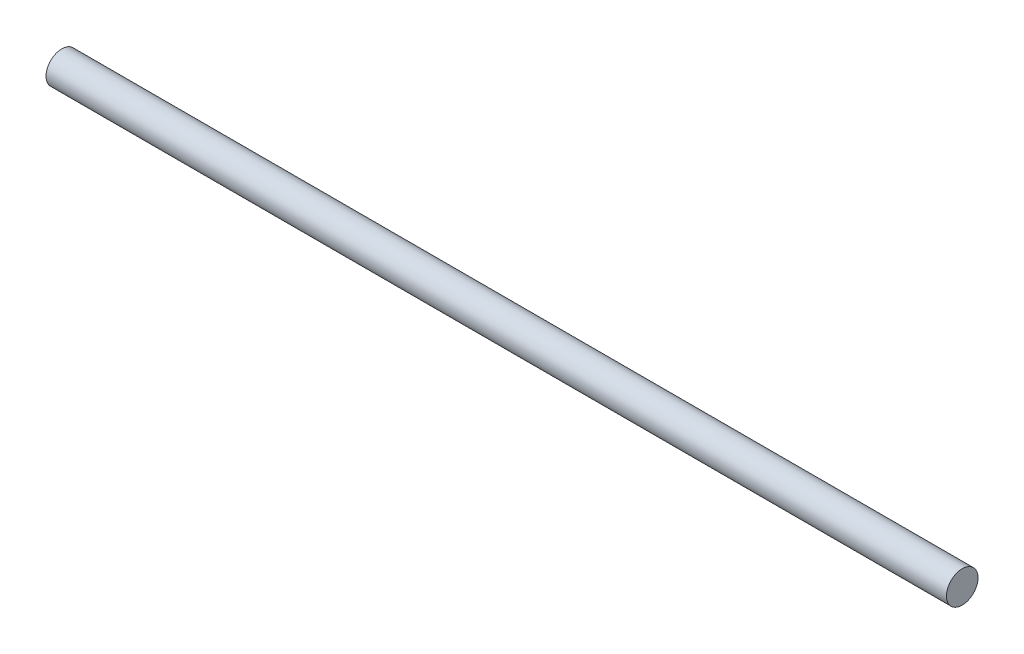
ISO-10303-21;
HEADER;
FILE_DESCRIPTION(('STEP AP214'),'2;1');
FILE_NAME('part.step','',(''),(''),'','','');
FILE_SCHEMA(('AUTOMOTIVE_DESIGN { 1 0 10303 214 1 1 1 1 }'));
ENDSEC;
DATA;
#1=APPLICATION_CONTEXT('core data for automotive mechanical design processes');
#2=APPLICATION_PROTOCOL_DEFINITION('international standard','automotive_design',2000,#1);
#3=PRODUCT_CONTEXT('',#1,'mechanical');
#4=PRODUCT('Part','Part','',(#3));
#5=PRODUCT_RELATED_PRODUCT_CATEGORY('part','',(#4));
#6=PRODUCT_DEFINITION_FORMATION('','',#4);
#7=PRODUCT_DEFINITION_CONTEXT('part definition',#1,'design');
#8=PRODUCT_DEFINITION('design','',#6,#7);
#9=PRODUCT_DEFINITION_SHAPE('','',#8);
#10=(LENGTH_UNIT() NAMED_UNIT(*) SI_UNIT(.MILLI.,.METRE.));
#11=(NAMED_UNIT(*) PLANE_ANGLE_UNIT() SI_UNIT($,.RADIAN.));
#12=(NAMED_UNIT(*) SI_UNIT($,.STERADIAN.) SOLID_ANGLE_UNIT());
#13=UNCERTAINTY_MEASURE_WITH_UNIT(LENGTH_MEASURE(1.E-05),#10,'distance_accuracy_value','');
#14=(GEOMETRIC_REPRESENTATION_CONTEXT(3) GLOBAL_UNCERTAINTY_ASSIGNED_CONTEXT((#13)) GLOBAL_UNIT_ASSIGNED_CONTEXT((#10,
#11,#12)) REPRESENTATION_CONTEXT('',''));
#15=CARTESIAN_POINT('',(0.,0.,0.));
#16=DIRECTION('',(0.,0.,1.));
#17=DIRECTION('',(1.,0.,0.));
#18=AXIS2_PLACEMENT_3D('',#15,#16,#17);
#19=CARTESIAN_POINT('',(0.,0.,0.));
#20=DIRECTION('',(1.,0.,0.));
#21=DIRECTION('',(0.,0.,-1.));
#22=AXIS2_PLACEMENT_3D('',#19,#20,#21);
#23=PLANE('',#22);
#24=CARTESIAN_POINT('',(0.,0.,0.));
#25=DIRECTION('',(-1.,0.,0.));
#26=DIRECTION('',(0.,0.,1.));
#27=AXIS2_PLACEMENT_3D('',#24,#25,#26);
#28=CIRCLE('',#27,6.35);
#29=CARTESIAN_POINT('',(0.,0.,6.35));
#30=VERTEX_POINT('',#29);
#31=EDGE_CURVE('E10',#30,#30,#28,.T.);
#32=ORIENTED_EDGE('',*,*,#31,.T.);
#33=EDGE_LOOP('',(#32));
#34=FACE_BOUND('',#33,.T.);
#35=ADVANCED_FACE('F30',(#34),#23,.F.);
#36=CARTESIAN_POINT('',(361.95,0.,0.));
#37=DIRECTION('',(-1.,0.,0.));
#38=DIRECTION('',(0.,0.,1.));
#39=AXIS2_PLACEMENT_3D('',#36,#37,#38);
#40=CYLINDRICAL_SURFACE('',#39,6.35);
#41=ORIENTED_EDGE('',*,*,#31,.F.);
#42=EDGE_LOOP('',(#41));
#43=FACE_BOUND('',#42,.T.);
#44=CARTESIAN_POINT('',(361.95,0.,0.));
#45=DIRECTION('',(-1.,0.,0.));
#46=DIRECTION('',(0.,0.,1.));
#47=AXIS2_PLACEMENT_3D('',#44,#45,#46);
#48=CIRCLE('',#47,6.35);
#49=CARTESIAN_POINT('',(361.95,0.,6.35));
#50=VERTEX_POINT('',#49);
#51=EDGE_CURVE('E36',#50,#50,#48,.T.);
#52=ORIENTED_EDGE('',*,*,#51,.T.);
#53=EDGE_LOOP('',(#52));
#54=FACE_BOUND('',#53,.T.);
#55=ADVANCED_FACE('F42',(#43,#54),#40,.T.);
#56=CARTESIAN_POINT('',(361.95,6.35,0.));
#57=DIRECTION('',(-1.,0.,0.));
#58=DIRECTION('',(0.,0.,1.));
#59=AXIS2_PLACEMENT_3D('',#56,#57,#58);
#60=PLANE('',#59);
#61=ORIENTED_EDGE('',*,*,#51,.F.);
#62=EDGE_LOOP('',(#61));
#63=FACE_BOUND('',#62,.T.);
#64=ADVANCED_FACE('F44',(#63),#60,.F.);
#65=CLOSED_SHELL('',(#35,#55,#64));
#66=MANIFOLD_SOLID_BREP('B2',#65);
#67=ADVANCED_BREP_SHAPE_REPRESENTATION('',(#18,#66),#14);
#68=SHAPE_DEFINITION_REPRESENTATION(#9,#67);
ENDSEC;
END-ISO-10303-21;
